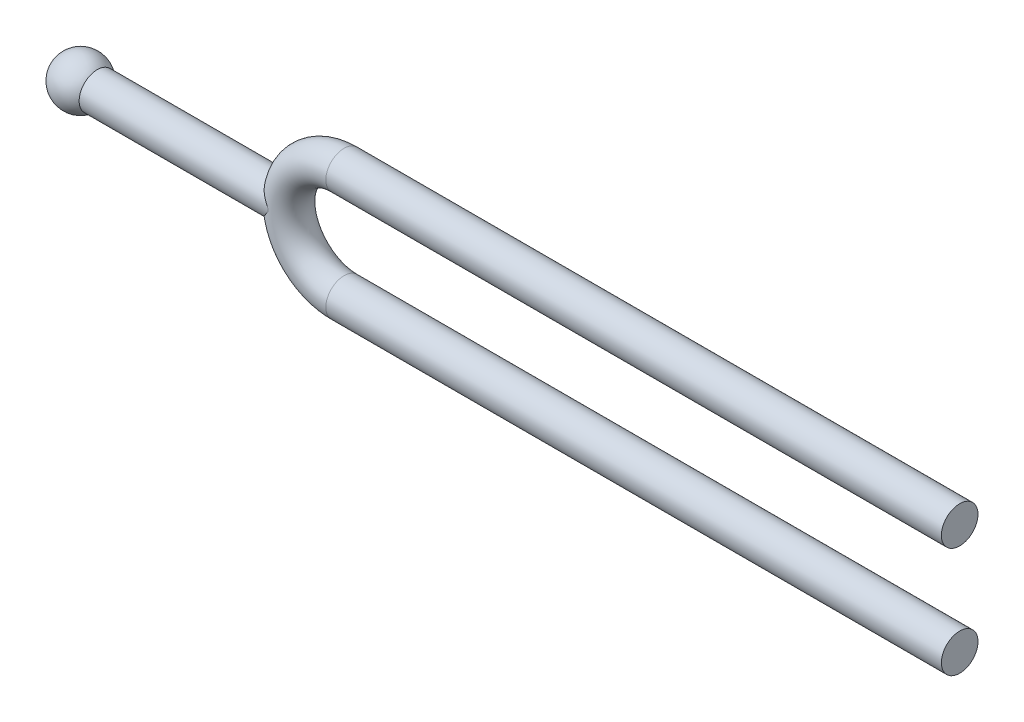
from build123d import *

# Parameters (mm, degrees)
SKETCH2_R                      = 2.225
BOSS_EXTRUDE1_REACH            = 107.203
BOSS_EXTRUDE1_END_MAJOR_RADIUS = 6.7
BOSS_EXTRUDE1_END_MINOR_RADIUS = 2.225
SKETCH3_R                      = 2.2
DOME1_FACE_RADIUS              = 2.2
DOME1_HEIGHT                   = 5


with BuildPart() as part:
    # Base-Sweep: sweep along a path in Sketch1
    with BuildLine(Plane.XY) as base_sweep_path:
        Line((74.8, 6.7), (0, 6.7))
        ThreePointArc((0, 6.7), (-6.7, 0), (0, -6.7))
        Line((0, -6.7), (74.8, -6.7))
    # Sketch2 → Base-Sweep (sweep)
    with BuildSketch(Plane(origin=(74.8, 0, 0), x_dir=(0, 0, -1), z_dir=(1, 0, 0))):
        with Locations((0, 6.7)):
            Circle(SKETCH2_R)
    sweep(path=base_sweep_path.line)

    # Boss-Extrude1: up to this torus (the profile starts outside it)
    boss_extrude1_end = Plane(origin=(0, 0, 0), z_dir=(0, 0, 1)) * Torus(BOSS_EXTRUDE1_END_MAJOR_RADIUS, BOSS_EXTRUDE1_END_MINOR_RADIUS, mode=Mode.PRIVATE)
    # Sketch3 → Boss-Extrude1 (add, up to the surface)
    with BuildSketch(Plane(origin=(-30, 0, 0), x_dir=(0, 0, -1), z_dir=(1, 0, 0)), mode=Mode.PRIVATE) as boss_extrude1_sk1:
        with Locations(Location((0, 0, 0), (0, 0, 312.412314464))):
            Circle(SKETCH3_R)
    boss_extrude1_tool1 = extrude(boss_extrude1_sk1.sketch, amount=BOSS_EXTRUDE1_REACH, mode=Mode.PRIVATE) - boss_extrude1_end
    add(boss_extrude1_tool1.solids().sort_by_distance((-30, 0, 0))[0])

    # Dome1: a dome of height H over a round flat face of radius A is a cap of a sphere of radius (A * A + H * H) / (2 * H)
    dome1_r = (DOME1_FACE_RADIUS * DOME1_FACE_RADIUS + DOME1_HEIGHT * DOME1_HEIGHT) / (2 * DOME1_HEIGHT)
    dome1_base = Plane((-30, 0, 0), z_dir=(-1, 0, 0))
    with Locations(dome1_base.offset(DOME1_HEIGHT - dome1_r)):
        dome1_ball = Sphere(dome1_r, mode=Mode.PRIVATE)
    add(split(dome1_ball, bisect_by=dome1_base, keep=Keep.TOP, mode=Mode.PRIVATE))


solid = part.part
